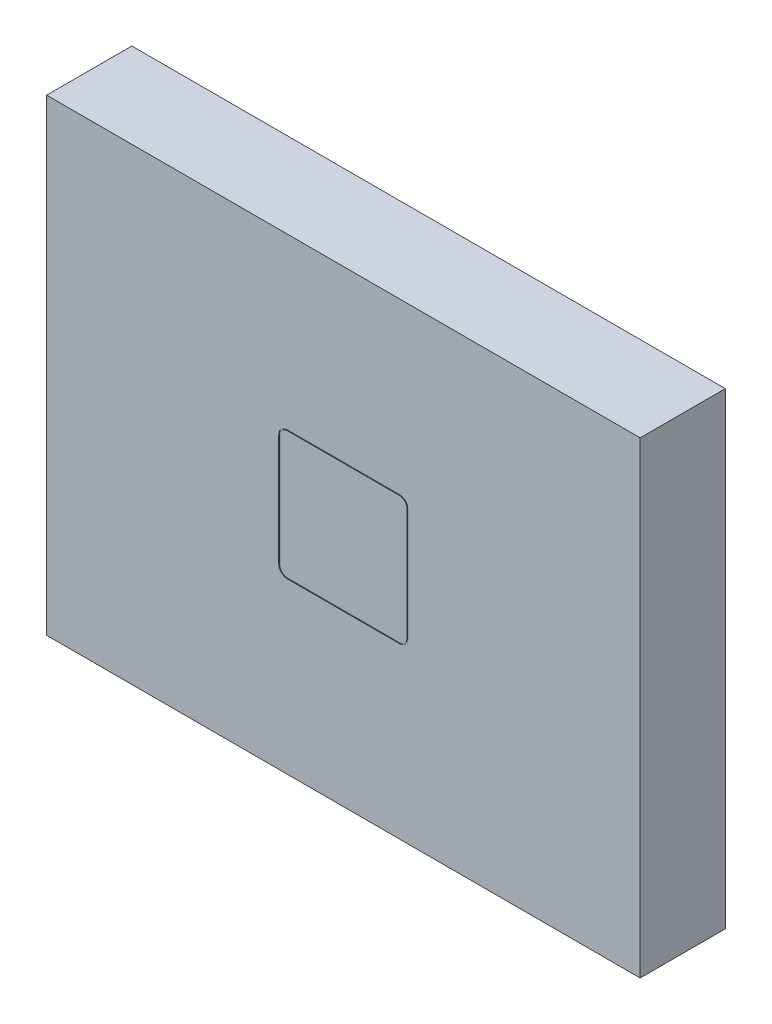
from build123d import *

# Parameters (mm, degrees)
SKETCH1_W           = 67000
SKETCH1_H           = 85000
BOSS_EXTRUDE1_DEPTH = 12195.2
CUT_EXTRUDE1_DEPTH  = 82.55


with BuildPart() as part:
    # Sketch1 → Boss-Extrude1 (new body)
    with BuildSketch(Plane(origin=(0, 0, 0), x_dir=(0, 1, 0), z_dir=(0, 0, 1))):
        Rectangle(SKETCH1_W, SKETCH1_H)
    extrude(amount=BOSS_EXTRUDE1_DEPTH)

    # Sketch4 → Cut-Extrude1 (cut)
    with BuildSketch(Plane.XY.offset(12195.2)):
        with BuildLine():
            Line((-9263.89, 8000.72), (-9263.89, -8000.72))
            ThreePointArc((-9263.89, -8000.72), (-8893.916072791, -8893.916072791), (-8000.72, -9263.89))
            Line((-8000.72, -9263.89), (8000.72, -9263.89))
            ThreePointArc((8000.72, -9263.89), (8893.916072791, -8893.916072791), (9263.89, -8000.72))
            Line((9263.89, -8000.72), (9263.89, 8000.72))
            ThreePointArc((9263.89, 8000.72), (8893.916072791, 8893.916072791), (8000.72, 9263.89))
            Line((8000.72, 9263.89), (-8000.72, 9263.89))
            ThreePointArc((-8000.72, 9263.89), (-8893.916072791, 8893.916072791), (-9263.89, 8000.72))
        make_face()
        with BuildLine():
            Line((-9111.49, 8000.72), (-9111.49, -8000.72))
            ThreePointArc((-9111.49, -8000.72), (-8786.152999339, -8786.152999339), (-8000.72, -9111.49))
            Line((-8000.72, -9111.49), (8000.72, -9111.49))
            ThreePointArc((8000.72, -9111.49), (8786.152999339, -8786.152999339), (9111.49, -8000.72))
            Line((9111.49, -8000.72), (9111.49, 8000.72))
            ThreePointArc((9111.49, 8000.72), (8786.152999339, 8786.152999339), (8000.72, 9111.49))
            Line((8000.72, 9111.49), (-8000.72, 9111.49))
            ThreePointArc((-8000.72, 9111.49), (-8786.152999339, 8786.152999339), (-9111.49, 8000.72))
        make_face(mode=Mode.SUBTRACT)
    extrude(amount=-CUT_EXTRUDE1_DEPTH, mode=Mode.SUBTRACT)


solid = part.part
